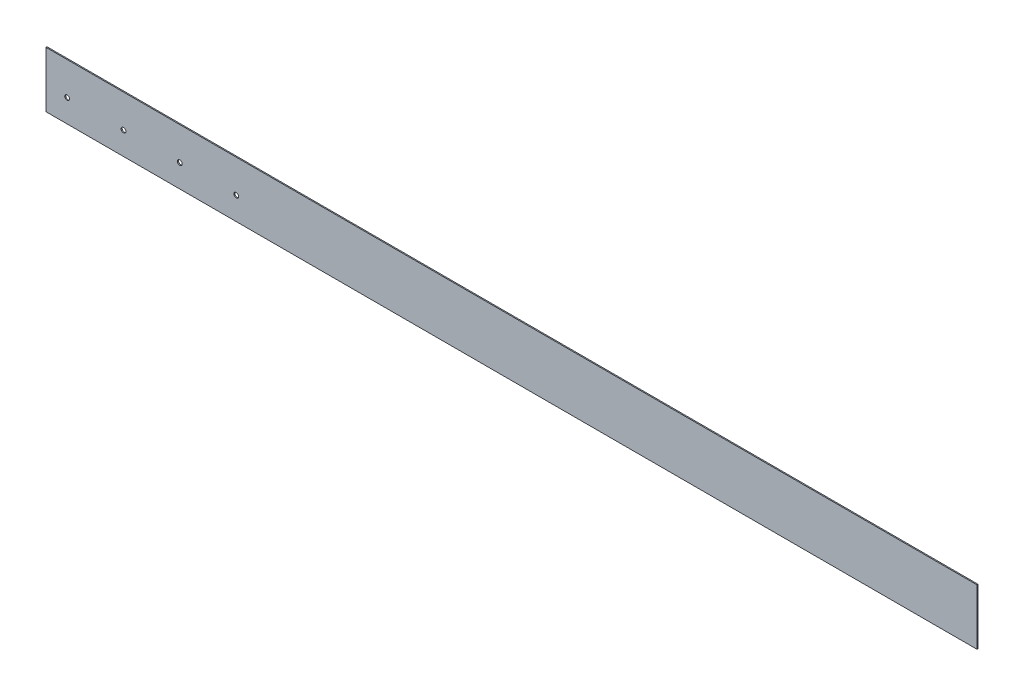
from build123d import *

# Parameters (mm, degrees)
SKETCH1_W                  = 8816.654643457
SKETCH1_H                  = 528.535100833
EXTRUDE1_DEPTH             = 10
F_45_0_45_DIAMETER_HOLE1_D = 45
LPATTERN1_COUNT            = 4
LPATTERN1_PITCH            = 533.817393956


with BuildPart() as part:
    # Sketch1 → Extrude1 (new body)
    with BuildSketch(Plane.XY):
        with Locations((4408.327321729, 264.267550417)):
            Rectangle(SKETCH1_W, SKETCH1_H)
    extrude(amount=EXTRUDE1_DEPTH)

    # 45.0 _45_ Diameter Hole1 (through all)
    with Locations(Plane.XY.offset(10)):
        with Locations((200, 216.299758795)):
            f_45_0_45_diameter_hole1 = Hole(F_45_0_45_DIAMETER_HOLE1_D / 2)

    # LPattern1: 45.0 _45_ Diameter Hole1 ×4
    with Locations(*[(i * LPATTERN1_PITCH, 0, 0) for i in range(1, LPATTERN1_COUNT)]):
        add(f_45_0_45_diameter_hole1, mode=Mode.SUBTRACT)


solid = part.part
